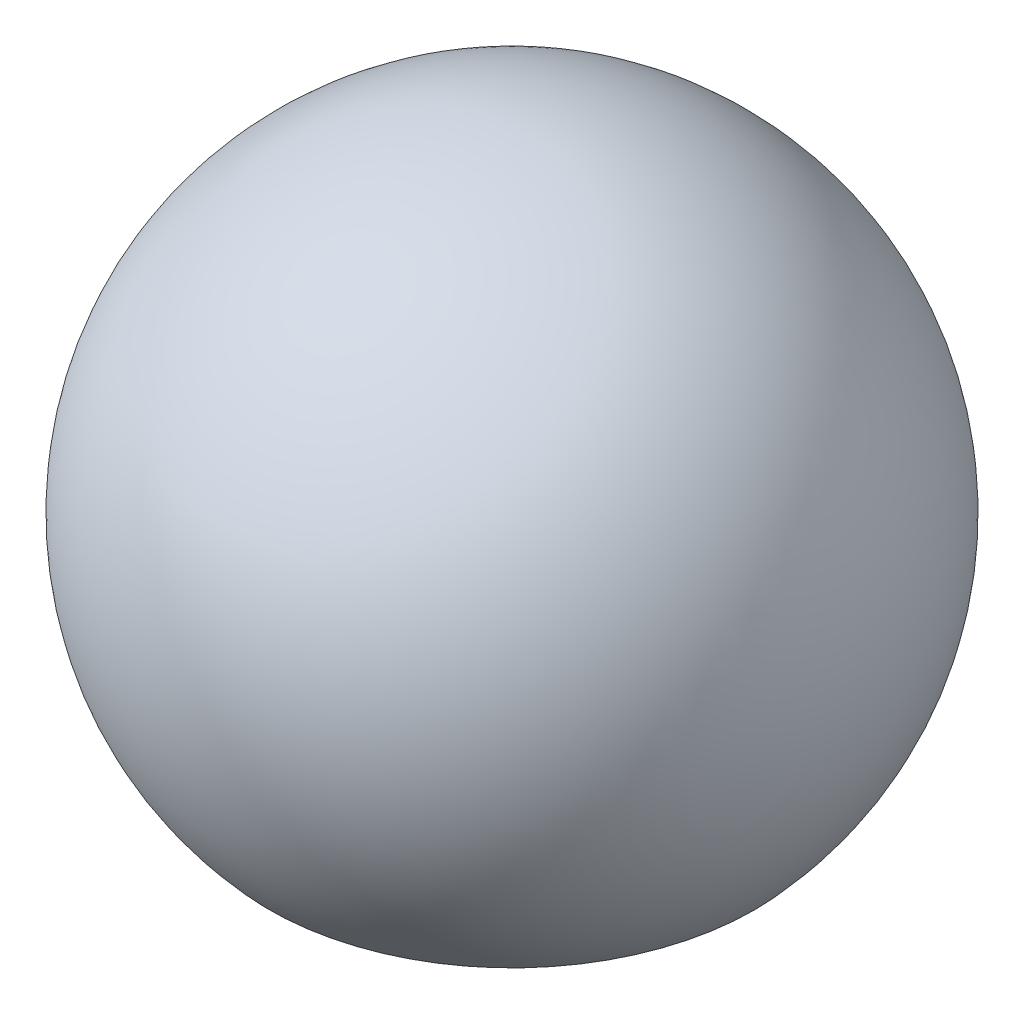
ISO-10303-21;
HEADER;
FILE_DESCRIPTION(('STEP AP214'),'2;1');
FILE_NAME('part.step','',(''),(''),'','','');
FILE_SCHEMA(('AUTOMOTIVE_DESIGN { 1 0 10303 214 1 1 1 1 }'));
ENDSEC;
DATA;
#1=APPLICATION_CONTEXT('core data for automotive mechanical design processes');
#2=APPLICATION_PROTOCOL_DEFINITION('international standard','automotive_design',2000,#1);
#3=PRODUCT_CONTEXT('',#1,'mechanical');
#4=PRODUCT('Part','Part','',(#3));
#5=PRODUCT_RELATED_PRODUCT_CATEGORY('part','',(#4));
#6=PRODUCT_DEFINITION_FORMATION('','',#4);
#7=PRODUCT_DEFINITION_CONTEXT('part definition',#1,'design');
#8=PRODUCT_DEFINITION('design','',#6,#7);
#9=PRODUCT_DEFINITION_SHAPE('','',#8);
#10=(LENGTH_UNIT() NAMED_UNIT(*) SI_UNIT(.MILLI.,.METRE.));
#11=(NAMED_UNIT(*) PLANE_ANGLE_UNIT() SI_UNIT($,.RADIAN.));
#12=(NAMED_UNIT(*) SI_UNIT($,.STERADIAN.) SOLID_ANGLE_UNIT());
#13=UNCERTAINTY_MEASURE_WITH_UNIT(LENGTH_MEASURE(1.E-05),#10,'distance_accuracy_value','');
#14=(GEOMETRIC_REPRESENTATION_CONTEXT(3) GLOBAL_UNCERTAINTY_ASSIGNED_CONTEXT((#13)) GLOBAL_UNIT_ASSIGNED_CONTEXT((#10,
#11,#12)) REPRESENTATION_CONTEXT('',''));
#15=CARTESIAN_POINT('',(0.,0.,0.));
#16=DIRECTION('',(0.,0.,1.));
#17=DIRECTION('',(1.,0.,0.));
#18=AXIS2_PLACEMENT_3D('',#15,#16,#17);
#19=CARTESIAN_POINT('',(0.,10.,0.));
#20=DIRECTION('',(0.,-1.,0.));
#21=DIRECTION('',(1.,0.,0.));
#22=AXIS2_PLACEMENT_3D('',#19,#20,#21);
#23=PLANE('',#22);
#24=CARTESIAN_POINT('',(0.,10.,0.));
#25=DIRECTION('',(0.,-1.,0.));
#26=DIRECTION('',(1.,0.,0.));
#27=AXIS2_PLACEMENT_3D('',#24,#25,#26);
#28=CIRCLE('',#27,2.5);
#29=CARTESIAN_POINT('',(2.5,10.,0.));
#30=VERTEX_POINT('',#29);
#31=EDGE_CURVE('E10',#30,#30,#28,.T.);
#32=ORIENTED_EDGE('',*,*,#31,.T.);
#33=EDGE_LOOP('',(#32));
#34=FACE_BOUND('',#33,.T.);
#35=ADVANCED_FACE('F26',(#34),#23,.T.);
#36=CARTESIAN_POINT('',(0.,0.,0.));
#37=DIRECTION('',(0.,-1.,0.));
#38=DIRECTION('',(1.,0.,0.));
#39=AXIS2_PLACEMENT_3D('',#36,#37,#38);
#40=CYLINDRICAL_SURFACE('',#39,2.5);
#41=CARTESIAN_POINT('',(0.,5.,0.));
#42=DIRECTION('',(0.,-1.,0.));
#43=DIRECTION('',(1.,0.,0.));
#44=AXIS2_PLACEMENT_3D('',#41,#42,#43);
#45=CIRCLE('',#44,2.5);
#46=CARTESIAN_POINT('',(2.5,5.,0.));
#47=VERTEX_POINT('',#46);
#48=EDGE_CURVE('E32',#47,#47,#45,.T.);
#49=ORIENTED_EDGE('',*,*,#48,.T.);
#50=EDGE_LOOP('',(#49));
#51=FACE_BOUND('',#50,.T.);
#52=ORIENTED_EDGE('',*,*,#31,.F.);
#53=EDGE_LOOP('',(#52));
#54=FACE_BOUND('',#53,.T.);
#55=ADVANCED_FACE('F52',(#51,#54),#40,.F.);
#56=CARTESIAN_POINT('',(0.,5.,0.));
#57=DIRECTION('',(0.,-1.,0.));
#58=DIRECTION('',(1.,0.,0.));
#59=AXIS2_PLACEMENT_3D('',#56,#57,#58);
#60=CONICAL_SURFACE('',#59,2.5,1.22173047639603);
#61=CARTESIAN_POINT('',(0.,3.2308739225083,0.));
#62=DIRECTION('',(0.,-1.,0.));
#63=DIRECTION('',(1.,0.,0.));
#64=AXIS2_PLACEMENT_3D('',#61,#62,#63);
#65=CIRCLE('',#64,7.36063395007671);
#66=CARTESIAN_POINT('',(7.36063395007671,3.2308739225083,0.));
#67=VERTEX_POINT('',#66);
#68=EDGE_CURVE('E36',#67,#67,#65,.T.);
#69=ORIENTED_EDGE('',*,*,#68,.T.);
#70=EDGE_LOOP('',(#69));
#71=FACE_BOUND('',#70,.T.);
#72=ORIENTED_EDGE('',*,*,#48,.F.);
#73=EDGE_LOOP('',(#72));
#74=FACE_BOUND('',#73,.T.);
#75=ADVANCED_FACE('F43',(#71,#74),#60,.F.);
#76=CARTESIAN_POINT('',(0.,10.,0.));
#77=DIRECTION('',(0.,-1.,0.));
#78=DIRECTION('',(1.,0.,0.));
#79=AXIS2_PLACEMENT_3D('',#76,#77,#78);
#80=SPHERICAL_SURFACE('',#79,10.);
#81=ORIENTED_EDGE('',*,*,#68,.F.);
#82=EDGE_LOOP('',(#81));
#83=FACE_BOUND('',#82,.T.);
#84=ADVANCED_FACE('F46',(#83),#80,.T.);
#85=CLOSED_SHELL('',(#35,#55,#75,#84));
#86=MANIFOLD_SOLID_BREP('B2',#85);
#87=ADVANCED_BREP_SHAPE_REPRESENTATION('',(#18,#86),#14);
#88=SHAPE_DEFINITION_REPRESENTATION(#9,#87);
ENDSEC;
END-ISO-10303-21;
